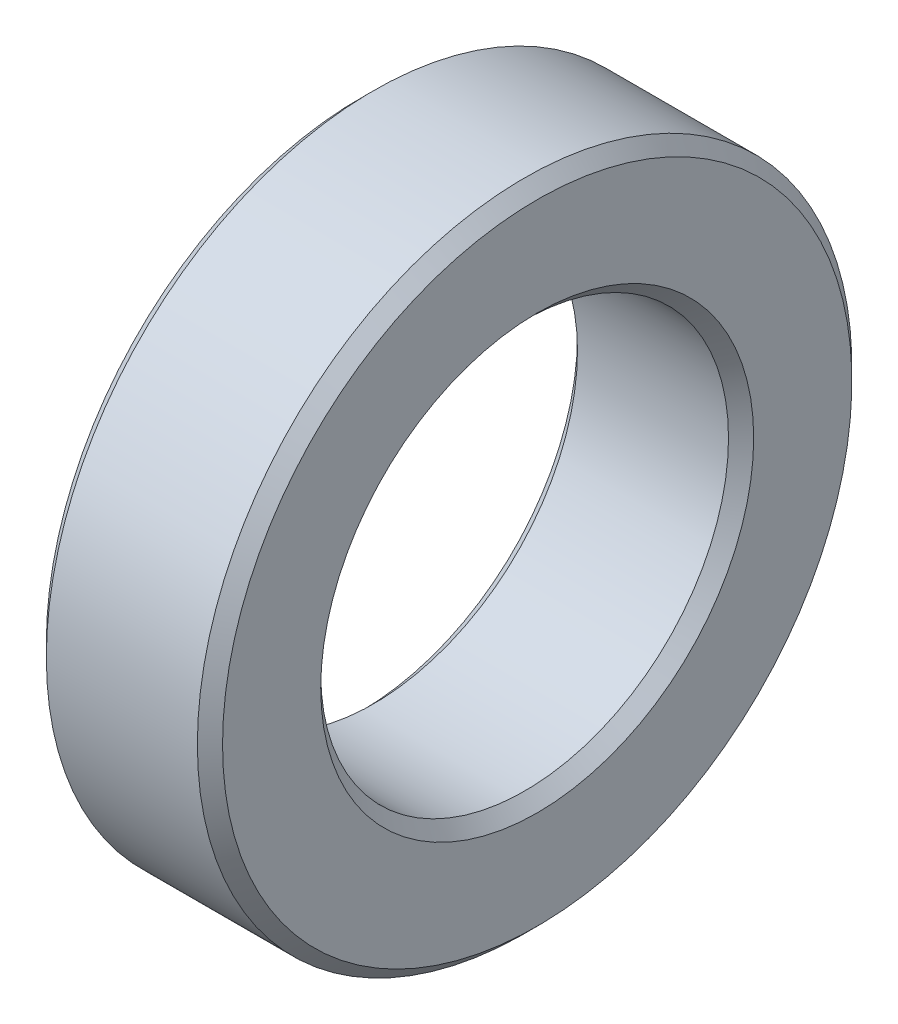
from build123d import *

# Parameters (mm, degrees)
SKETCH_1_W     = 7
SKETCH_1_H     = 4.9
CHAMFER_1_SIZE = 0.5


with BuildPart() as part:
    # Sketch 1 → Revolve 1 (revolve)
    with BuildSketch(Plane.XY, mode=Mode.PRIVATE) as revolve_1_sk:
        with Locations((3.5, 10.55)):
            Rectangle(SKETCH_1_W, SKETCH_1_H)
    revolve(revolve_1_sk.sketch.rotate(Axis((0, 0, 0), (1, 0, 0)), 90), axis=Axis((0, 0, 0), (1, 0, 0)))

    # Chamfer 1
    chamfer_1_edges = [part.edges().sort_by_distance(p)[0] for p in [
        (0, 0, -13),
        (7, 0, -13),
        (7, 0, -8.1),
        (0, 0, -8.1),
    ]]
    chamfer(chamfer_1_edges, length=CHAMFER_1_SIZE)


solid = part.part
